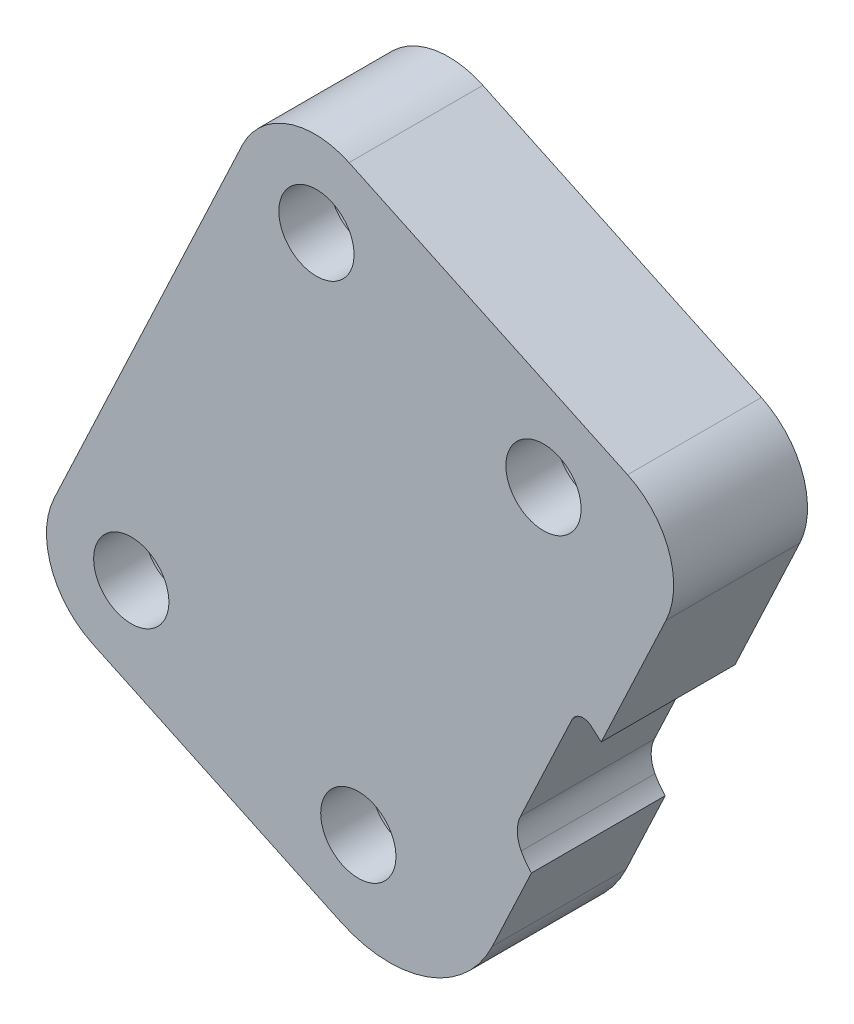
ISO-10303-21;
HEADER;
FILE_DESCRIPTION(('STEP AP214'),'2;1');
FILE_NAME('part.step','',(''),(''),'','','');
FILE_SCHEMA(('AUTOMOTIVE_DESIGN { 1 0 10303 214 1 1 1 1 }'));
ENDSEC;
DATA;
#1=APPLICATION_CONTEXT('core data for automotive mechanical design processes');
#2=APPLICATION_PROTOCOL_DEFINITION('international standard','automotive_design',2000,#1);
#3=PRODUCT_CONTEXT('',#1,'mechanical');
#4=PRODUCT('Part','Part','',(#3));
#5=PRODUCT_RELATED_PRODUCT_CATEGORY('part','',(#4));
#6=PRODUCT_DEFINITION_FORMATION('','',#4);
#7=PRODUCT_DEFINITION_CONTEXT('part definition',#1,'design');
#8=PRODUCT_DEFINITION('design','',#6,#7);
#9=PRODUCT_DEFINITION_SHAPE('','',#8);
#10=(LENGTH_UNIT() NAMED_UNIT(*) SI_UNIT(.MILLI.,.METRE.));
#11=(NAMED_UNIT(*) PLANE_ANGLE_UNIT() SI_UNIT($,.RADIAN.));
#12=(NAMED_UNIT(*) SI_UNIT($,.STERADIAN.) SOLID_ANGLE_UNIT());
#13=UNCERTAINTY_MEASURE_WITH_UNIT(LENGTH_MEASURE(1.E-05),#10,'distance_accuracy_value','');
#14=(GEOMETRIC_REPRESENTATION_CONTEXT(3) GLOBAL_UNCERTAINTY_ASSIGNED_CONTEXT((#13)) GLOBAL_UNIT_ASSIGNED_CONTEXT((#10,
#11,#12)) REPRESENTATION_CONTEXT('',''));
#15=CARTESIAN_POINT('',(0.,0.,0.));
#16=DIRECTION('',(0.,0.,1.));
#17=DIRECTION('',(1.,0.,0.));
#18=AXIS2_PLACEMENT_3D('',#15,#16,#17);
#19=CARTESIAN_POINT('',(-347.024105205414,7.1484132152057,15.8999999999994));
#20=DIRECTION('',(0.904832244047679,-0.425768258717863,0.));
#21=DIRECTION('',(0.425768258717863,0.904832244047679,0.));
#22=AXIS2_PLACEMENT_3D('',#19,#20,#21);
#23=PLANE('',#22);
#24=DIRECTION('',(0.,0.,1.));
#25=VECTOR('',#24,1.);
#26=CARTESIAN_POINT('',(-353.173963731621,-5.92111504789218,15.8999999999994));
#27=LINE('',#26,#25);
#28=CARTESIAN_POINT('',(-353.173963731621,-5.9211150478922,3.19999999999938));
#29=VERTEX_POINT('',#28);
#30=CARTESIAN_POINT('',(-353.173963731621,-5.9211150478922,15.8999999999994));
#31=VERTEX_POINT('',#30);
#32=EDGE_CURVE('E191',#29,#31,#27,.T.);
#33=ORIENTED_EDGE('',*,*,#32,.F.);
#34=DIRECTION('',(-0.425768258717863,-0.904832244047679,0.));
#35=VECTOR('',#34,1.);
#36=CARTESIAN_POINT('',(-347.024105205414,7.1484132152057,3.19999999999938));
#37=LINE('',#36,#35);
#38=CARTESIAN_POINT('',(-347.024105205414,7.1484132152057,3.19999999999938));
#39=VERTEX_POINT('',#38);
#40=EDGE_CURVE('E160',#39,#29,#37,.T.);
#41=ORIENTED_EDGE('',*,*,#40,.F.);
#42=DIRECTION('',(0.,0.,-1.));
#43=VECTOR('',#42,1.);
#44=CARTESIAN_POINT('',(-347.024105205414,7.1484132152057,15.8999999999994));
#45=LINE('',#44,#43);
#46=CARTESIAN_POINT('',(-347.024105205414,7.1484132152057,15.8999999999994));
#47=VERTEX_POINT('',#46);
#48=EDGE_CURVE('E105',#47,#39,#45,.T.);
#49=ORIENTED_EDGE('',*,*,#48,.F.);
#50=DIRECTION('',(-0.425768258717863,-0.904832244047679,0.));
#51=VECTOR('',#50,1.);
#52=CARTESIAN_POINT('',(-347.024105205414,7.1484132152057,15.8999999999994));
#53=LINE('',#52,#51);
#54=EDGE_CURVE('E236',#47,#31,#53,.T.);
#55=ORIENTED_EDGE('',*,*,#54,.T.);
#56=EDGE_LOOP('',(#33,#41,#49,#55));
#57=FACE_BOUND('',#56,.T.);
#58=ADVANCED_FACE('F43',(#57),#23,.T.);
#59=CARTESIAN_POINT('',(-353.918926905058,10.3927673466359,15.8999999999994));
#60=DIRECTION('',(0.,0.,-1.));
#61=DIRECTION('',(-1.,0.,0.));
#62=AXIS2_PLACEMENT_3D('',#59,#60,#61);
#63=CYLINDRICAL_SURFACE('',#62,7.62);
#64=CARTESIAN_POINT('',(-353.918926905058,10.3927673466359,3.19999999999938));
#65=DIRECTION('',(0.,0.,-1.));
#66=DIRECTION('',(1.,0.,0.));
#67=AXIS2_PLACEMENT_3D('',#64,#65,#66);
#68=CIRCLE('',#67,7.62);
#69=CARTESIAN_POINT('',(-350.674572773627,17.2875890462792,3.19999999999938));
#70=VERTEX_POINT('',#69);
#71=EDGE_CURVE('E155',#70,#39,#68,.T.);
#72=ORIENTED_EDGE('',*,*,#71,.F.);
#73=DIRECTION('',(0.,0.,-1.));
#74=VECTOR('',#73,1.);
#75=CARTESIAN_POINT('',(-350.674572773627,17.2875890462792,15.8999999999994));
#76=LINE('',#75,#74);
#77=CARTESIAN_POINT('',(-350.674572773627,17.2875890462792,15.8999999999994));
#78=VERTEX_POINT('',#77);
#79=EDGE_CURVE('E51',#78,#70,#76,.T.);
#80=ORIENTED_EDGE('',*,*,#79,.F.);
#81=CARTESIAN_POINT('',(-353.918926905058,10.3927673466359,15.8999999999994));
#82=DIRECTION('',(0.,0.,-1.));
#83=DIRECTION('',(1.,0.,0.));
#84=AXIS2_PLACEMENT_3D('',#81,#82,#83);
#85=CIRCLE('',#84,7.62);
#86=EDGE_CURVE('E178',#78,#47,#85,.T.);
#87=ORIENTED_EDGE('',*,*,#86,.T.);
#88=ORIENTED_EDGE('',*,*,#48,.T.);
#89=EDGE_LOOP('',(#72,#80,#87,#88));
#90=FACE_BOUND('',#89,.T.);
#91=ADVANCED_FACE('F45',(#90),#63,.T.);
#92=CARTESIAN_POINT('',(-350.674572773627,17.2875890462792,15.8999999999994));
#93=DIRECTION('',(0.425768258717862,0.904832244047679,0.));
#94=DIRECTION('',(-0.904832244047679,0.425768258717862,0.));
#95=AXIS2_PLACEMENT_3D('',#92,#93,#94);
#96=PLANE('',#95);
#97=DIRECTION('',(0.904832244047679,-0.425768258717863,0.));
#98=VECTOR('',#97,1.);
#99=CARTESIAN_POINT('',(-350.674572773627,17.2875890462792,3.19999999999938));
#100=LINE('',#99,#98);
#101=CARTESIAN_POINT('',(-377.10472262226,29.724279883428,3.19999999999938));
#102=VERTEX_POINT('',#101);
#103=EDGE_CURVE('E175',#102,#70,#100,.T.);
#104=ORIENTED_EDGE('',*,*,#103,.F.);
#105=DIRECTION('',(0.,0.,-1.));
#106=VECTOR('',#105,1.);
#107=CARTESIAN_POINT('',(-377.10472262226,29.724279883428,15.8999999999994));
#108=LINE('',#107,#106);
#109=CARTESIAN_POINT('',(-377.10472262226,29.724279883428,15.8999999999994));
#110=VERTEX_POINT('',#109);
#111=EDGE_CURVE('E135',#110,#102,#108,.T.);
#112=ORIENTED_EDGE('',*,*,#111,.F.);
#113=DIRECTION('',(0.904832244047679,-0.425768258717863,0.));
#114=VECTOR('',#113,1.);
#115=CARTESIAN_POINT('',(-350.674572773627,17.2875890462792,15.8999999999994));
#116=LINE('',#115,#114);
#117=EDGE_CURVE('E145',#110,#78,#116,.T.);
#118=ORIENTED_EDGE('',*,*,#117,.T.);
#119=ORIENTED_EDGE('',*,*,#79,.T.);
#120=EDGE_LOOP('',(#104,#112,#118,#119));
#121=FACE_BOUND('',#120,.T.);
#122=ADVANCED_FACE('F194',(#121),#96,.T.);
#123=CARTESIAN_POINT('',(-380.34907675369,22.8294581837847,15.8999999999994));
#124=DIRECTION('',(0.,0.,-1.));
#125=DIRECTION('',(-1.,0.,0.));
#126=AXIS2_PLACEMENT_3D('',#123,#124,#125);
#127=CYLINDRICAL_SURFACE('',#126,7.62);
#128=CARTESIAN_POINT('',(-380.34907675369,22.8294581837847,3.19999999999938));
#129=DIRECTION('',(0.,0.,-1.));
#130=DIRECTION('',(1.,0.,0.));
#131=AXIS2_PLACEMENT_3D('',#128,#129,#130);
#132=CIRCLE('',#131,7.62);
#133=CARTESIAN_POINT('',(-387.243898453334,26.0738123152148,3.19999999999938));
#134=VERTEX_POINT('',#133);
#135=EDGE_CURVE('E130',#134,#102,#132,.T.);
#136=ORIENTED_EDGE('',*,*,#135,.F.);
#137=DIRECTION('',(0.,0.,-1.));
#138=VECTOR('',#137,1.);
#139=CARTESIAN_POINT('',(-387.243898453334,26.0738123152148,15.8999999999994));
#140=LINE('',#139,#138);
#141=CARTESIAN_POINT('',(-387.243898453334,26.0738123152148,15.8999999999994));
#142=VERTEX_POINT('',#141);
#143=EDGE_CURVE('E124',#142,#134,#140,.T.);
#144=ORIENTED_EDGE('',*,*,#143,.F.);
#145=CARTESIAN_POINT('',(-380.34907675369,22.8294581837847,15.8999999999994));
#146=DIRECTION('',(0.,0.,-1.));
#147=DIRECTION('',(1.,0.,0.));
#148=AXIS2_PLACEMENT_3D('',#145,#146,#147);
#149=CIRCLE('',#148,7.62);
#150=EDGE_CURVE('E127',#142,#110,#149,.T.);
#151=ORIENTED_EDGE('',*,*,#150,.T.);
#152=ORIENTED_EDGE('',*,*,#111,.T.);
#153=EDGE_LOOP('',(#136,#144,#151,#152));
#154=FACE_BOUND('',#153,.T.);
#155=ADVANCED_FACE('F126',(#154),#127,.T.);
#156=CARTESIAN_POINT('',(-387.243898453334,26.0738123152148,15.8999999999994));
#157=DIRECTION('',(-0.904832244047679,0.425768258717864,0.));
#158=DIRECTION('',(-0.425768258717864,-0.904832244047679,0.));
#159=AXIS2_PLACEMENT_3D('',#156,#157,#158);
#160=PLANE('',#159);
#161=DIRECTION('',(0.425768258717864,0.904832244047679,0.));
#162=VECTOR('',#161,1.);
#163=CARTESIAN_POINT('',(-387.243898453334,26.0738123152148,3.19999999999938));
#164=LINE('',#163,#162);
#165=CARTESIAN_POINT('',(-405.087846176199,-11.8477070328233,3.19999999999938));
#166=VERTEX_POINT('',#165);
#167=EDGE_CURVE('E172',#166,#134,#164,.T.);
#168=ORIENTED_EDGE('',*,*,#167,.F.);
#169=DIRECTION('',(0.,0.,-1.));
#170=VECTOR('',#169,1.);
#171=CARTESIAN_POINT('',(-405.087846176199,-11.8477070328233,15.8999999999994));
#172=LINE('',#171,#170);
#173=CARTESIAN_POINT('',(-405.087846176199,-11.8477070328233,15.8999999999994));
#174=VERTEX_POINT('',#173);
#175=EDGE_CURVE('E136',#174,#166,#172,.T.);
#176=ORIENTED_EDGE('',*,*,#175,.F.);
#177=DIRECTION('',(0.425768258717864,0.904832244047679,0.));
#178=VECTOR('',#177,1.);
#179=CARTESIAN_POINT('',(-387.243898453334,26.0738123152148,15.8999999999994));
#180=LINE('',#179,#178);
#181=EDGE_CURVE('E143',#174,#142,#180,.T.);
#182=ORIENTED_EDGE('',*,*,#181,.T.);
#183=ORIENTED_EDGE('',*,*,#143,.T.);
#184=EDGE_LOOP('',(#168,#176,#182,#183));
#185=FACE_BOUND('',#184,.T.);
#186=ADVANCED_FACE('F147',(#185),#160,.T.);
#187=CARTESIAN_POINT('',(-398.193024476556,-15.0920611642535,15.8999999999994));
#188=DIRECTION('',(0.,0.,-1.));
#189=DIRECTION('',(-1.,0.,0.));
#190=AXIS2_PLACEMENT_3D('',#187,#188,#189);
#191=CYLINDRICAL_SURFACE('',#190,7.62000000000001);
#192=CARTESIAN_POINT('',(-398.193024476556,-15.0920611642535,3.19999999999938));
#193=DIRECTION('',(0.,0.,-1.));
#194=DIRECTION('',(-1.,0.,0.));
#195=AXIS2_PLACEMENT_3D('',#192,#193,#194);
#196=CIRCLE('',#195,7.62000000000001);
#197=CARTESIAN_POINT('',(-401.437378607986,-21.9868828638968,3.19999999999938));
#198=VERTEX_POINT('',#197);
#199=EDGE_CURVE('E169',#198,#166,#196,.T.);
#200=ORIENTED_EDGE('',*,*,#199,.F.);
#201=DIRECTION('',(0.,0.,-1.));
#202=VECTOR('',#201,1.);
#203=CARTESIAN_POINT('',(-401.437378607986,-21.9868828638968,15.8999999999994));
#204=LINE('',#203,#202);
#205=CARTESIAN_POINT('',(-401.437378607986,-21.9868828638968,15.8999999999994));
#206=VERTEX_POINT('',#205);
#207=EDGE_CURVE('E182',#206,#198,#204,.T.);
#208=ORIENTED_EDGE('',*,*,#207,.F.);
#209=CARTESIAN_POINT('',(-398.193024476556,-15.0920611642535,15.8999999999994));
#210=DIRECTION('',(0.,0.,-1.));
#211=DIRECTION('',(-1.,0.,0.));
#212=AXIS2_PLACEMENT_3D('',#209,#210,#211);
#213=CIRCLE('',#212,7.62000000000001);
#214=EDGE_CURVE('E148',#206,#174,#213,.T.);
#215=ORIENTED_EDGE('',*,*,#214,.T.);
#216=ORIENTED_EDGE('',*,*,#175,.T.);
#217=EDGE_LOOP('',(#200,#208,#215,#216));
#218=FACE_BOUND('',#217,.T.);
#219=ADVANCED_FACE('F590',(#218),#191,.T.);
#220=CARTESIAN_POINT('',(-377.880071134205,-33.0717594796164,15.8999999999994));
#221=DIRECTION('',(-0.425768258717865,-0.904832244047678,0.));
#222=DIRECTION('',(0.904832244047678,-0.425768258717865,0.));
#223=AXIS2_PLACEMENT_3D('',#220,#221,#222);
#224=PLANE('',#223);
#225=DIRECTION('',(-0.904832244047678,0.425768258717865,0.));
#226=VECTOR('',#225,1.);
#227=CARTESIAN_POINT('',(-377.880071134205,-33.0717594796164,3.19999999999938));
#228=LINE('',#227,#226);
#229=CARTESIAN_POINT('',(-377.880071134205,-33.0717594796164,3.19999999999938));
#230=VERTEX_POINT('',#229);
#231=EDGE_CURVE('E166',#230,#198,#228,.T.);
#232=ORIENTED_EDGE('',*,*,#231,.F.);
#233=DIRECTION('',(0.,0.,-1.));
#234=VECTOR('',#233,1.);
#235=CARTESIAN_POINT('',(-377.880071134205,-33.0717594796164,15.8999999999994));
#236=LINE('',#235,#234);
#237=CARTESIAN_POINT('',(-377.880071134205,-33.0717594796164,15.8999999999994));
#238=VERTEX_POINT('',#237);
#239=EDGE_CURVE('E184',#238,#230,#236,.T.);
#240=ORIENTED_EDGE('',*,*,#239,.F.);
#241=DIRECTION('',(-0.904832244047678,0.425768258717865,0.));
#242=VECTOR('',#241,1.);
#243=CARTESIAN_POINT('',(-377.880071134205,-33.0717594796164,15.8999999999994));
#244=LINE('',#243,#242);
#245=EDGE_CURVE('E150',#238,#206,#244,.T.);
#246=ORIENTED_EDGE('',*,*,#245,.T.);
#247=ORIENTED_EDGE('',*,*,#207,.T.);
#248=EDGE_LOOP('',(#232,#240,#246,#247));
#249=FACE_BOUND('',#248,.T.);
#250=ADVANCED_FACE('F218',(#249),#224,.T.);
#251=CARTESIAN_POINT('',(-373.283902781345,-23.3040954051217,15.8999999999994));
#252=DIRECTION('',(0.,0.,-1.));
#253=DIRECTION('',(-1.,0.,0.));
#254=AXIS2_PLACEMENT_3D('',#251,#252,#253);
#255=CYLINDRICAL_SURFACE('',#254,10.795);
#256=CARTESIAN_POINT('',(-373.283902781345,-23.3040954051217,3.19999999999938));
#257=DIRECTION('',(0.,0.,-1.));
#258=DIRECTION('',(-1.,0.,0.));
#259=AXIS2_PLACEMENT_3D('',#256,#257,#258);
#260=CIRCLE('',#259,10.795);
#261=CARTESIAN_POINT('',(-363.516238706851,-27.9002637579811,3.19999999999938));
#262=VERTEX_POINT('',#261);
#263=EDGE_CURVE('E163',#262,#230,#260,.T.);
#264=ORIENTED_EDGE('',*,*,#263,.F.);
#265=DIRECTION('',(0.,0.,-1.));
#266=VECTOR('',#265,1.);
#267=CARTESIAN_POINT('',(-363.516238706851,-27.9002637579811,15.8999999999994));
#268=LINE('',#267,#266);
#269=CARTESIAN_POINT('',(-363.516238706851,-27.9002637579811,15.8999999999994));
#270=VERTEX_POINT('',#269);
#271=EDGE_CURVE('E186',#270,#262,#268,.T.);
#272=ORIENTED_EDGE('',*,*,#271,.F.);
#273=CARTESIAN_POINT('',(-373.283902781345,-23.3040954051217,15.8999999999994));
#274=DIRECTION('',(0.,0.,-1.));
#275=DIRECTION('',(-1.,0.,0.));
#276=AXIS2_PLACEMENT_3D('',#273,#274,#275);
#277=CIRCLE('',#276,10.795);
#278=EDGE_CURVE('E235',#270,#238,#277,.T.);
#279=ORIENTED_EDGE('',*,*,#278,.T.);
#280=ORIENTED_EDGE('',*,*,#239,.T.);
#281=EDGE_LOOP('',(#264,#272,#279,#280));
#282=FACE_BOUND('',#281,.T.);
#283=ADVANCED_FACE('F210',(#282),#255,.T.);
#284=DIRECTION('',(0.,0.,1.));
#285=VECTOR('',#284,1.);
#286=CARTESIAN_POINT('',(-359.799879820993,-20.0023491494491,3.19999999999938));
#287=LINE('',#286,#285);
#288=CARTESIAN_POINT('',(-359.799879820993,-20.0023491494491,15.8999999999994));
#289=VERTEX_POINT('',#288);
#290=CARTESIAN_POINT('',(-359.799879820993,-20.0023491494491,3.19999999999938));
#291=VERTEX_POINT('',#290);
#292=EDGE_CURVE('E58',#289,#291,#287,.F.);
#293=ORIENTED_EDGE('',*,*,#292,.F.);
#294=EDGE_CURVE('E223',#289,#270,#53,.T.);
#295=ORIENTED_EDGE('',*,*,#294,.T.);
#296=ORIENTED_EDGE('',*,*,#271,.T.);
#297=EDGE_CURVE('E158',#291,#262,#37,.T.);
#298=ORIENTED_EDGE('',*,*,#297,.F.);
#299=EDGE_LOOP('',(#293,#295,#296,#298));
#300=FACE_BOUND('',#299,.T.);
#301=ADVANCED_FACE('F204',(#300),#23,.T.);
#302=CARTESIAN_POINT('',(-353.918926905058,10.3927673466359,15.8999999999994));
#303=DIRECTION('',(0.,0.,1.));
#304=DIRECTION('',(1.,0.,0.));
#305=AXIS2_PLACEMENT_3D('',#302,#303,#304);
#306=PLANE('',#305);
#307=CARTESIAN_POINT('',(-380.196973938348,22.4069925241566,15.8999999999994));
#308=DIRECTION('',(0.,0.,-1.));
#309=DIRECTION('',(-1.,0.,0.));
#310=AXIS2_PLACEMENT_3D('',#307,#308,#309);
#311=CIRCLE('',#310,3.56869999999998);
#312=CARTESIAN_POINT('',(-383.765673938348,22.4069925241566,15.8999999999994));
#313=VERTEX_POINT('',#312);
#314=EDGE_CURVE('E366',#313,#313,#311,.T.);
#315=ORIENTED_EDGE('',*,*,#314,.T.);
#316=EDGE_LOOP('',(#315));
#317=FACE_BOUND('',#316,.T.);
#318=CARTESIAN_POINT('',(-376.224241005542,-25.0785650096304,15.8999999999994));
#319=DIRECTION('',(0.,0.,-1.));
#320=DIRECTION('',(-1.,0.,0.));
#321=AXIS2_PLACEMENT_3D('',#318,#319,#320);
#322=CIRCLE('',#321,3.56869999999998);
#323=CARTESIAN_POINT('',(-379.792941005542,-25.0785650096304,15.8999999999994));
#324=VERTEX_POINT('',#323);
#325=EDGE_CURVE('E356',#324,#324,#322,.T.);
#326=ORIENTED_EDGE('',*,*,#325,.T.);
#327=EDGE_LOOP('',(#326));
#328=FACE_BOUND('',#327,.T.);
#329=CARTESIAN_POINT('',(-397.770558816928,-14.9399583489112,15.8999999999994));
#330=DIRECTION('',(0.,0.,-1.));
#331=DIRECTION('',(-1.,0.,0.));
#332=AXIS2_PLACEMENT_3D('',#329,#330,#331);
#333=CIRCLE('',#332,3.56869999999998);
#334=CARTESIAN_POINT('',(-401.339258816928,-14.9399583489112,15.8999999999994));
#335=VERTEX_POINT('',#334);
#336=EDGE_CURVE('E346',#335,#335,#333,.T.);
#337=ORIENTED_EDGE('',*,*,#336,.T.);
#338=EDGE_LOOP('',(#337));
#339=FACE_BOUND('',#338,.T.);
#340=CARTESIAN_POINT('',(-358.650656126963,12.2683858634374,15.8999999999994));
#341=DIRECTION('',(0.,0.,-1.));
#342=DIRECTION('',(-1.,0.,0.));
#343=AXIS2_PLACEMENT_3D('',#340,#341,#342);
#344=CIRCLE('',#343,3.56869999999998);
#345=CARTESIAN_POINT('',(-362.219356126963,12.2683858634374,15.8999999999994));
#346=VERTEX_POINT('',#345);
#347=EDGE_CURVE('E336',#346,#346,#344,.T.);
#348=ORIENTED_EDGE('',*,*,#347,.T.);
#349=EDGE_LOOP('',(#348));
#350=FACE_BOUND('',#349,.T.);
#351=DIRECTION('',(-0.755030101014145,0.655690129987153,0.));
#352=VECTOR('',#351,1.);
#353=CARTESIAN_POINT('',(-361.675090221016,1.46151079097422,15.8999999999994));
#354=LINE('',#353,#352);
#355=CARTESIAN_POINT('',(-354.134813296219,-5.08668530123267,15.8999999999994));
#356=VERTEX_POINT('',#355);
#357=EDGE_CURVE('E227',#31,#356,#354,.T.);
#358=ORIENTED_EDGE('',*,*,#357,.F.);
#359=ORIENTED_EDGE('',*,*,#54,.F.);
#360=ORIENTED_EDGE('',*,*,#86,.F.);
#361=ORIENTED_EDGE('',*,*,#117,.F.);
#362=ORIENTED_EDGE('',*,*,#150,.F.);
#363=ORIENTED_EDGE('',*,*,#181,.F.);
#364=ORIENTED_EDGE('',*,*,#214,.F.);
#365=ORIENTED_EDGE('',*,*,#245,.F.);
#366=ORIENTED_EDGE('',*,*,#278,.F.);
#367=ORIENTED_EDGE('',*,*,#294,.F.);
#368=CARTESIAN_POINT('',(-355.705949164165,-15.9990361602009,15.8999999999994));
#369=DIRECTION('',(0.,0.,1.));
#370=DIRECTION('',(1.,0.,0.));
#371=AXIS2_PLACEMENT_3D('',#368,#369,#370);
#372=CIRCLE('',#371,5.72597442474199);
#373=CARTESIAN_POINT('',(-360.76720793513,-18.6768044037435,15.8999999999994));
#374=VERTEX_POINT('',#373);
#375=EDGE_CURVE('E228',#374,#289,#372,.T.);
#376=ORIENTED_EDGE('',*,*,#375,.F.);
#377=CARTESIAN_POINT('',(-357.977308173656,-17.2007476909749,15.8999999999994));
#378=DIRECTION('',(0.,0.,1.));
#379=DIRECTION('',(1.,0.,0.));
#380=AXIS2_PLACEMENT_3D('',#377,#378,#379);
#381=CIRCLE('',#380,3.15630861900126);
#382=CARTESIAN_POINT('',(-360.833237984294,-15.8568916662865,15.8999999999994));
#383=VERTEX_POINT('',#382);
#384=EDGE_CURVE('E159',#383,#374,#381,.T.);
#385=ORIENTED_EDGE('',*,*,#384,.F.);
#386=DIRECTION('',(-0.425768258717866,-0.904832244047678,0.));
#387=VECTOR('',#386,1.);
#388=CARTESIAN_POINT('',(-349.467170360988,8.29799602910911,15.8999999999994));
#389=LINE('',#388,#387);
#390=CARTESIAN_POINT('',(-355.945050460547,-5.46863562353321,15.8999999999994));
#391=VERTEX_POINT('',#390);
#392=EDGE_CURVE('E281',#391,#383,#389,.T.);
#393=ORIENTED_EDGE('',*,*,#392,.F.);
#394=CARTESIAN_POINT('',(-354.895426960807,-5.9625353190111,15.8999999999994));
#395=DIRECTION('',(0.,0.,1.));
#396=DIRECTION('',(1.,0.,0.));
#397=AXIS2_PLACEMENT_3D('',#394,#395,#396);
#398=CIRCLE('',#397,1.16002);
#399=EDGE_CURVE('E278',#356,#391,#398,.T.);
#400=ORIENTED_EDGE('',*,*,#399,.F.);
#401=EDGE_LOOP('',(#358,#359,#360,#361,#362,#363,#364,#365,#366,#367,#376,#385,#393,#400));
#402=FACE_BOUND('',#401,.T.);
#403=ADVANCED_FACE('F141',(#317,#328,#339,#350,#402),#306,.T.);
#404=CARTESIAN_POINT('',(-353.918926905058,10.3927673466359,3.19999999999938));
#405=DIRECTION('',(0.,0.,1.));
#406=DIRECTION('',(1.,0.,0.));
#407=AXIS2_PLACEMENT_3D('',#404,#405,#406);
#408=PLANE('',#407);
#409=CARTESIAN_POINT('',(-380.196973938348,22.4069925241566,3.19999999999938));
#410=DIRECTION('',(0.,0.,-1.));
#411=DIRECTION('',(-1.,0.,0.));
#412=AXIS2_PLACEMENT_3D('',#409,#410,#411);
#413=CIRCLE('',#412,5.35940000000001);
#414=CARTESIAN_POINT('',(-385.556373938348,22.4069925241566,3.19999999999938));
#415=VERTEX_POINT('',#414);
#416=EDGE_CURVE('E317',#415,#415,#413,.T.);
#417=ORIENTED_EDGE('',*,*,#416,.F.);
#418=EDGE_LOOP('',(#417));
#419=FACE_BOUND('',#418,.T.);
#420=CARTESIAN_POINT('',(-376.224241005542,-25.0785650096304,3.19999999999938));
#421=DIRECTION('',(0.,0.,-1.));
#422=DIRECTION('',(-1.,0.,0.));
#423=AXIS2_PLACEMENT_3D('',#420,#421,#422);
#424=CIRCLE('',#423,5.35940000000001);
#425=CARTESIAN_POINT('',(-381.583641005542,-25.0785650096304,3.19999999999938));
#426=VERTEX_POINT('',#425);
#427=EDGE_CURVE('E321',#426,#426,#424,.T.);
#428=ORIENTED_EDGE('',*,*,#427,.F.);
#429=EDGE_LOOP('',(#428));
#430=FACE_BOUND('',#429,.T.);
#431=CARTESIAN_POINT('',(-397.770558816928,-14.9399583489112,3.19999999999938));
#432=DIRECTION('',(0.,0.,-1.));
#433=DIRECTION('',(-1.,0.,0.));
#434=AXIS2_PLACEMENT_3D('',#431,#432,#433);
#435=CIRCLE('',#434,5.35940000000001);
#436=CARTESIAN_POINT('',(-403.129958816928,-14.9399583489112,3.19999999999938));
#437=VERTEX_POINT('',#436);
#438=EDGE_CURVE('E325',#437,#437,#435,.T.);
#439=ORIENTED_EDGE('',*,*,#438,.F.);
#440=EDGE_LOOP('',(#439));
#441=FACE_BOUND('',#440,.T.);
#442=CARTESIAN_POINT('',(-358.650656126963,12.2683858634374,3.19999999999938));
#443=DIRECTION('',(0.,0.,-1.));
#444=DIRECTION('',(-1.,0.,0.));
#445=AXIS2_PLACEMENT_3D('',#442,#443,#444);
#446=CIRCLE('',#445,5.35940000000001);
#447=CARTESIAN_POINT('',(-364.010056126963,12.2683858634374,3.19999999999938));
#448=VERTEX_POINT('',#447);
#449=EDGE_CURVE('E258',#448,#448,#446,.T.);
#450=ORIENTED_EDGE('',*,*,#449,.F.);
#451=EDGE_LOOP('',(#450));
#452=FACE_BOUND('',#451,.T.);
#453=ORIENTED_EDGE('',*,*,#40,.T.);
#454=DIRECTION('',(-0.755030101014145,0.655690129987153,0.));
#455=VECTOR('',#454,1.);
#456=CARTESIAN_POINT('',(-361.675090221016,1.46151079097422,3.19999999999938));
#457=LINE('',#456,#455);
#458=CARTESIAN_POINT('',(-354.134813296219,-5.08668530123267,3.19999999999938));
#459=VERTEX_POINT('',#458);
#460=EDGE_CURVE('E11',#29,#459,#457,.T.);
#461=ORIENTED_EDGE('',*,*,#460,.T.);
#462=CARTESIAN_POINT('',(-354.895426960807,-5.9625353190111,3.19999999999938));
#463=DIRECTION('',(0.,0.,1.));
#464=DIRECTION('',(1.,0.,0.));
#465=AXIS2_PLACEMENT_3D('',#462,#463,#464);
#466=CIRCLE('',#465,1.16002);
#467=CARTESIAN_POINT('',(-355.945050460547,-5.46863562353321,3.19999999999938));
#468=VERTEX_POINT('',#467);
#469=EDGE_CURVE('E253',#459,#468,#466,.T.);
#470=ORIENTED_EDGE('',*,*,#469,.T.);
#471=DIRECTION('',(-0.425768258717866,-0.904832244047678,0.));
#472=VECTOR('',#471,1.);
#473=CARTESIAN_POINT('',(-360.833237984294,-15.8568916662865,3.19999999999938));
#474=LINE('',#473,#472);
#475=CARTESIAN_POINT('',(-360.833237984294,-15.8568916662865,3.19999999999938));
#476=VERTEX_POINT('',#475);
#477=EDGE_CURVE('E256',#468,#476,#474,.T.);
#478=ORIENTED_EDGE('',*,*,#477,.T.);
#479=CARTESIAN_POINT('',(-357.977308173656,-17.2007476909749,3.19999999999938));
#480=DIRECTION('',(0.,0.,1.));
#481=DIRECTION('',(1.,0.,0.));
#482=AXIS2_PLACEMENT_3D('',#479,#480,#481);
#483=CIRCLE('',#482,3.15630861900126);
#484=CARTESIAN_POINT('',(-360.76720793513,-18.6768044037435,3.19999999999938));
#485=VERTEX_POINT('',#484);
#486=EDGE_CURVE('E251',#476,#485,#483,.T.);
#487=ORIENTED_EDGE('',*,*,#486,.T.);
#488=CARTESIAN_POINT('',(-355.705949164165,-15.9990361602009,3.19999999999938));
#489=DIRECTION('',(0.,0.,1.));
#490=DIRECTION('',(1.,0.,0.));
#491=AXIS2_PLACEMENT_3D('',#488,#489,#490);
#492=CIRCLE('',#491,5.72597442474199);
#493=EDGE_CURVE('E247',#485,#291,#492,.T.);
#494=ORIENTED_EDGE('',*,*,#493,.T.);
#495=ORIENTED_EDGE('',*,*,#297,.T.);
#496=ORIENTED_EDGE('',*,*,#263,.T.);
#497=ORIENTED_EDGE('',*,*,#231,.T.);
#498=ORIENTED_EDGE('',*,*,#199,.T.);
#499=ORIENTED_EDGE('',*,*,#167,.T.);
#500=ORIENTED_EDGE('',*,*,#135,.T.);
#501=ORIENTED_EDGE('',*,*,#103,.T.);
#502=ORIENTED_EDGE('',*,*,#71,.T.);
#503=EDGE_LOOP('',(#453,#461,#470,#478,#487,#494,#495,#496,#497,#498,#499,#500,#501,#502));
#504=FACE_BOUND('',#503,.T.);
#505=ADVANCED_FACE('F193',(#419,#430,#441,#452,#504),#408,.F.);
#506=CARTESIAN_POINT('',(-357.977308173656,-17.2007476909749,3.19999999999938));
#507=DIRECTION('',(0.,0.,1.));
#508=DIRECTION('',(1.,0.,0.));
#509=AXIS2_PLACEMENT_3D('',#506,#507,#508);
#510=CYLINDRICAL_SURFACE('',#509,3.15630861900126);
#511=ORIENTED_EDGE('',*,*,#384,.T.);
#512=DIRECTION('',(0.,0.,1.));
#513=VECTOR('',#512,1.);
#514=CARTESIAN_POINT('',(-360.76720793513,-18.6768044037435,3.19999999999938));
#515=LINE('',#514,#513);
#516=EDGE_CURVE('E263',#485,#374,#515,.T.);
#517=ORIENTED_EDGE('',*,*,#516,.F.);
#518=ORIENTED_EDGE('',*,*,#486,.F.);
#519=DIRECTION('',(0.,0.,1.));
#520=VECTOR('',#519,1.);
#521=CARTESIAN_POINT('',(-360.833237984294,-15.8568916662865,3.19999999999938));
#522=LINE('',#521,#520);
#523=EDGE_CURVE('E264',#476,#383,#522,.T.);
#524=ORIENTED_EDGE('',*,*,#523,.T.);
#525=EDGE_LOOP('',(#511,#517,#518,#524));
#526=FACE_BOUND('',#525,.T.);
#527=ADVANCED_FACE('F286',(#526),#510,.F.);
#528=CARTESIAN_POINT('',(-360.833237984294,-15.8568916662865,3.19999999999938));
#529=DIRECTION('',(-0.904832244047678,0.425768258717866,0.));
#530=DIRECTION('',(-0.425768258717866,-0.904832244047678,0.));
#531=AXIS2_PLACEMENT_3D('',#528,#529,#530);
#532=PLANE('',#531);
#533=ORIENTED_EDGE('',*,*,#392,.T.);
#534=ORIENTED_EDGE('',*,*,#523,.F.);
#535=ORIENTED_EDGE('',*,*,#477,.F.);
#536=DIRECTION('',(0.,0.,1.));
#537=VECTOR('',#536,1.);
#538=CARTESIAN_POINT('',(-355.945050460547,-5.46863562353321,3.19999999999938));
#539=LINE('',#538,#537);
#540=EDGE_CURVE('E267',#468,#391,#539,.T.);
#541=ORIENTED_EDGE('',*,*,#540,.T.);
#542=EDGE_LOOP('',(#533,#534,#535,#541));
#543=FACE_BOUND('',#542,.T.);
#544=ADVANCED_FACE('F308',(#543),#532,.F.);
#545=CARTESIAN_POINT('',(-354.895426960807,-5.9625353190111,3.19999999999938));
#546=DIRECTION('',(0.,0.,1.));
#547=DIRECTION('',(1.,0.,0.));
#548=AXIS2_PLACEMENT_3D('',#545,#546,#547);
#549=CYLINDRICAL_SURFACE('',#548,1.16002);
#550=ORIENTED_EDGE('',*,*,#399,.T.);
#551=ORIENTED_EDGE('',*,*,#540,.F.);
#552=ORIENTED_EDGE('',*,*,#469,.F.);
#553=DIRECTION('',(0.,0.,1.));
#554=VECTOR('',#553,1.);
#555=CARTESIAN_POINT('',(-354.134813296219,-5.08668530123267,3.19999999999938));
#556=LINE('',#555,#554);
#557=EDGE_CURVE('E270',#459,#356,#556,.T.);
#558=ORIENTED_EDGE('',*,*,#557,.T.);
#559=EDGE_LOOP('',(#550,#551,#552,#558));
#560=FACE_BOUND('',#559,.T.);
#561=ADVANCED_FACE('F303',(#560),#549,.F.);
#562=CARTESIAN_POINT('',(-354.134813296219,-5.08668530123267,3.19999999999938));
#563=DIRECTION('',(0.655690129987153,0.755030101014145,0.));
#564=DIRECTION('',(-0.755030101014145,0.655690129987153,0.));
#565=AXIS2_PLACEMENT_3D('',#562,#563,#564);
#566=PLANE('',#565);
#567=ORIENTED_EDGE('',*,*,#32,.T.);
#568=ORIENTED_EDGE('',*,*,#357,.T.);
#569=ORIENTED_EDGE('',*,*,#557,.F.);
#570=ORIENTED_EDGE('',*,*,#460,.F.);
#571=EDGE_LOOP('',(#567,#568,#569,#570));
#572=FACE_BOUND('',#571,.T.);
#573=ADVANCED_FACE('F294',(#572),#566,.F.);
#574=CARTESIAN_POINT('',(-355.705949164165,-15.9990361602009,3.19999999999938));
#575=DIRECTION('',(0.,0.,1.));
#576=DIRECTION('',(1.,0.,0.));
#577=AXIS2_PLACEMENT_3D('',#574,#575,#576);
#578=CYLINDRICAL_SURFACE('',#577,5.72597442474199);
#579=ORIENTED_EDGE('',*,*,#292,.T.);
#580=ORIENTED_EDGE('',*,*,#493,.F.);
#581=ORIENTED_EDGE('',*,*,#516,.T.);
#582=ORIENTED_EDGE('',*,*,#375,.T.);
#583=EDGE_LOOP('',(#579,#580,#581,#582));
#584=FACE_BOUND('',#583,.T.);
#585=ADVANCED_FACE('F291',(#584),#578,.F.);
#586=CARTESIAN_POINT('',(-358.650656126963,12.2683858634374,3.19999999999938));
#587=DIRECTION('',(0.,0.,-1.));
#588=DIRECTION('',(-1.,0.,0.));
#589=AXIS2_PLACEMENT_3D('',#586,#587,#588);
#590=CYLINDRICAL_SURFACE('',#589,5.35940000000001);
#591=CARTESIAN_POINT('',(-358.650656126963,12.2683858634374,11.0739999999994));
#592=DIRECTION('',(0.,0.,-1.));
#593=DIRECTION('',(-1.,0.,0.));
#594=AXIS2_PLACEMENT_3D('',#591,#592,#593);
#595=CIRCLE('',#594,5.35940000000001);
#596=CARTESIAN_POINT('',(-364.010056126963,12.2683858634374,11.0739999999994));
#597=VERTEX_POINT('',#596);
#598=EDGE_CURVE('E329',#597,#597,#595,.T.);
#599=ORIENTED_EDGE('',*,*,#598,.F.);
#600=EDGE_LOOP('',(#599));
#601=FACE_BOUND('',#600,.T.);
#602=ORIENTED_EDGE('',*,*,#449,.T.);
#603=EDGE_LOOP('',(#602));
#604=FACE_BOUND('',#603,.T.);
#605=ADVANCED_FACE('F293',(#601,#604),#590,.F.);
#606=CARTESIAN_POINT('',(-355.081956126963,12.2683858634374,11.0739999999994));
#607=DIRECTION('',(0.,0.,1.));
#608=DIRECTION('',(1.,0.,0.));
#609=AXIS2_PLACEMENT_3D('',#606,#607,#608);
#610=PLANE('',#609);
#611=CARTESIAN_POINT('',(-358.650656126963,12.2683858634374,11.0739999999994));
#612=DIRECTION('',(0.,0.,-1.));
#613=DIRECTION('',(-1.,0.,0.));
#614=AXIS2_PLACEMENT_3D('',#611,#612,#613);
#615=CIRCLE('',#614,3.56869999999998);
#616=CARTESIAN_POINT('',(-362.219356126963,12.2683858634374,11.0739999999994));
#617=VERTEX_POINT('',#616);
#618=EDGE_CURVE('E331',#617,#617,#615,.T.);
#619=ORIENTED_EDGE('',*,*,#618,.F.);
#620=EDGE_LOOP('',(#619));
#621=FACE_BOUND('',#620,.T.);
#622=ORIENTED_EDGE('',*,*,#598,.T.);
#623=EDGE_LOOP('',(#622));
#624=FACE_BOUND('',#623,.T.);
#625=ADVANCED_FACE('F300',(#621,#624),#610,.F.);
#626=CARTESIAN_POINT('',(-358.650656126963,12.2683858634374,3.19999999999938));
#627=DIRECTION('',(0.,0.,-1.));
#628=DIRECTION('',(-1.,0.,0.));
#629=AXIS2_PLACEMENT_3D('',#626,#627,#628);
#630=CYLINDRICAL_SURFACE('',#629,3.56869999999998);
#631=ORIENTED_EDGE('',*,*,#347,.F.);
#632=EDGE_LOOP('',(#631));
#633=FACE_BOUND('',#632,.T.);
#634=ORIENTED_EDGE('',*,*,#618,.T.);
#635=EDGE_LOOP('',(#634));
#636=FACE_BOUND('',#635,.T.);
#637=ADVANCED_FACE('F413',(#633,#636),#630,.F.);
#638=CARTESIAN_POINT('',(-397.770558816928,-14.9399583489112,3.19999999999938));
#639=DIRECTION('',(0.,0.,-1.));
#640=DIRECTION('',(-1.,0.,0.));
#641=AXIS2_PLACEMENT_3D('',#638,#639,#640);
#642=CYLINDRICAL_SURFACE('',#641,5.35940000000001);
#643=CARTESIAN_POINT('',(-397.770558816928,-14.9399583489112,11.0739999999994));
#644=DIRECTION('',(0.,0.,-1.));
#645=DIRECTION('',(-1.,0.,0.));
#646=AXIS2_PLACEMENT_3D('',#643,#644,#645);
#647=CIRCLE('',#646,5.35940000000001);
#648=CARTESIAN_POINT('',(-403.129958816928,-14.9399583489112,11.0739999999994));
#649=VERTEX_POINT('',#648);
#650=EDGE_CURVE('E340',#649,#649,#647,.T.);
#651=ORIENTED_EDGE('',*,*,#650,.F.);
#652=EDGE_LOOP('',(#651));
#653=FACE_BOUND('',#652,.T.);
#654=ORIENTED_EDGE('',*,*,#438,.T.);
#655=EDGE_LOOP('',(#654));
#656=FACE_BOUND('',#655,.T.);
#657=ADVANCED_FACE('F409',(#653,#656),#642,.F.);
#658=CARTESIAN_POINT('',(-394.201858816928,-14.9399583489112,11.0739999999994));
#659=DIRECTION('',(0.,0.,1.));
#660=DIRECTION('',(1.,0.,0.));
#661=AXIS2_PLACEMENT_3D('',#658,#659,#660);
#662=PLANE('',#661);
#663=CARTESIAN_POINT('',(-397.770558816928,-14.9399583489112,11.0739999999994));
#664=DIRECTION('',(0.,0.,-1.));
#665=DIRECTION('',(-1.,0.,0.));
#666=AXIS2_PLACEMENT_3D('',#663,#664,#665);
#667=CIRCLE('',#666,3.56869999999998);
#668=CARTESIAN_POINT('',(-401.339258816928,-14.9399583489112,11.0739999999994));
#669=VERTEX_POINT('',#668);
#670=EDGE_CURVE('E343',#669,#669,#667,.T.);
#671=ORIENTED_EDGE('',*,*,#670,.F.);
#672=EDGE_LOOP('',(#671));
#673=FACE_BOUND('',#672,.T.);
#674=ORIENTED_EDGE('',*,*,#650,.T.);
#675=EDGE_LOOP('',(#674));
#676=FACE_BOUND('',#675,.T.);
#677=ADVANCED_FACE('F405',(#673,#676),#662,.F.);
#678=CARTESIAN_POINT('',(-397.770558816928,-14.9399583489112,3.19999999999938));
#679=DIRECTION('',(0.,0.,-1.));
#680=DIRECTION('',(-1.,0.,0.));
#681=AXIS2_PLACEMENT_3D('',#678,#679,#680);
#682=CYLINDRICAL_SURFACE('',#681,3.56869999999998);
#683=ORIENTED_EDGE('',*,*,#336,.F.);
#684=EDGE_LOOP('',(#683));
#685=FACE_BOUND('',#684,.T.);
#686=ORIENTED_EDGE('',*,*,#670,.T.);
#687=EDGE_LOOP('',(#686));
#688=FACE_BOUND('',#687,.T.);
#689=ADVANCED_FACE('F401',(#685,#688),#682,.F.);
#690=CARTESIAN_POINT('',(-376.224241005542,-25.0785650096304,3.19999999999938));
#691=DIRECTION('',(0.,0.,-1.));
#692=DIRECTION('',(-1.,0.,0.));
#693=AXIS2_PLACEMENT_3D('',#690,#691,#692);
#694=CYLINDRICAL_SURFACE('',#693,5.35940000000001);
#695=CARTESIAN_POINT('',(-376.224241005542,-25.0785650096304,11.0739999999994));
#696=DIRECTION('',(0.,0.,-1.));
#697=DIRECTION('',(-1.,0.,0.));
#698=AXIS2_PLACEMENT_3D('',#695,#696,#697);
#699=CIRCLE('',#698,5.35940000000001);
#700=CARTESIAN_POINT('',(-381.583641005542,-25.0785650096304,11.0739999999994));
#701=VERTEX_POINT('',#700);
#702=EDGE_CURVE('E350',#701,#701,#699,.T.);
#703=ORIENTED_EDGE('',*,*,#702,.F.);
#704=EDGE_LOOP('',(#703));
#705=FACE_BOUND('',#704,.T.);
#706=ORIENTED_EDGE('',*,*,#427,.T.);
#707=EDGE_LOOP('',(#706));
#708=FACE_BOUND('',#707,.T.);
#709=ADVANCED_FACE('F397',(#705,#708),#694,.F.);
#710=CARTESIAN_POINT('',(-372.655541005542,-25.0785650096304,11.0739999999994));
#711=DIRECTION('',(0.,0.,1.));
#712=DIRECTION('',(1.,0.,0.));
#713=AXIS2_PLACEMENT_3D('',#710,#711,#712);
#714=PLANE('',#713);
#715=CARTESIAN_POINT('',(-376.224241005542,-25.0785650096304,11.0739999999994));
#716=DIRECTION('',(0.,0.,-1.));
#717=DIRECTION('',(-1.,0.,0.));
#718=AXIS2_PLACEMENT_3D('',#715,#716,#717);
#719=CIRCLE('',#718,3.56869999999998);
#720=CARTESIAN_POINT('',(-379.792941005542,-25.0785650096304,11.0739999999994));
#721=VERTEX_POINT('',#720);
#722=EDGE_CURVE('E353',#721,#721,#719,.T.);
#723=ORIENTED_EDGE('',*,*,#722,.F.);
#724=EDGE_LOOP('',(#723));
#725=FACE_BOUND('',#724,.T.);
#726=ORIENTED_EDGE('',*,*,#702,.T.);
#727=EDGE_LOOP('',(#726));
#728=FACE_BOUND('',#727,.T.);
#729=ADVANCED_FACE('F391',(#725,#728),#714,.F.);
#730=CARTESIAN_POINT('',(-376.224241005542,-25.0785650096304,3.19999999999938));
#731=DIRECTION('',(0.,0.,-1.));
#732=DIRECTION('',(-1.,0.,0.));
#733=AXIS2_PLACEMENT_3D('',#730,#731,#732);
#734=CYLINDRICAL_SURFACE('',#733,3.56869999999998);
#735=ORIENTED_EDGE('',*,*,#325,.F.);
#736=EDGE_LOOP('',(#735));
#737=FACE_BOUND('',#736,.T.);
#738=ORIENTED_EDGE('',*,*,#722,.T.);
#739=EDGE_LOOP('',(#738));
#740=FACE_BOUND('',#739,.T.);
#741=ADVANCED_FACE('F386',(#737,#740),#734,.F.);
#742=CARTESIAN_POINT('',(-380.196973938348,22.4069925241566,3.19999999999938));
#743=DIRECTION('',(0.,0.,-1.));
#744=DIRECTION('',(-1.,0.,0.));
#745=AXIS2_PLACEMENT_3D('',#742,#743,#744);
#746=CYLINDRICAL_SURFACE('',#745,5.35940000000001);
#747=CARTESIAN_POINT('',(-380.196973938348,22.4069925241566,11.0739999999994));
#748=DIRECTION('',(0.,0.,-1.));
#749=DIRECTION('',(-1.,0.,0.));
#750=AXIS2_PLACEMENT_3D('',#747,#748,#749);
#751=CIRCLE('',#750,5.35940000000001);
#752=CARTESIAN_POINT('',(-385.556373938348,22.4069925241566,11.0739999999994));
#753=VERTEX_POINT('',#752);
#754=EDGE_CURVE('E360',#753,#753,#751,.T.);
#755=ORIENTED_EDGE('',*,*,#754,.F.);
#756=EDGE_LOOP('',(#755));
#757=FACE_BOUND('',#756,.T.);
#758=ORIENTED_EDGE('',*,*,#416,.T.);
#759=EDGE_LOOP('',(#758));
#760=FACE_BOUND('',#759,.T.);
#761=ADVANCED_FACE('F380',(#757,#760),#746,.F.);
#762=CARTESIAN_POINT('',(-376.628273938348,22.4069925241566,11.0739999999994));
#763=DIRECTION('',(0.,0.,1.));
#764=DIRECTION('',(1.,0.,0.));
#765=AXIS2_PLACEMENT_3D('',#762,#763,#764);
#766=PLANE('',#765);
#767=CARTESIAN_POINT('',(-380.196973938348,22.4069925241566,11.0739999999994));
#768=DIRECTION('',(0.,0.,-1.));
#769=DIRECTION('',(-1.,0.,0.));
#770=AXIS2_PLACEMENT_3D('',#767,#768,#769);
#771=CIRCLE('',#770,3.56869999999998);
#772=CARTESIAN_POINT('',(-383.765673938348,22.4069925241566,11.0739999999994));
#773=VERTEX_POINT('',#772);
#774=EDGE_CURVE('E363',#773,#773,#771,.T.);
#775=ORIENTED_EDGE('',*,*,#774,.F.);
#776=EDGE_LOOP('',(#775));
#777=FACE_BOUND('',#776,.T.);
#778=ORIENTED_EDGE('',*,*,#754,.T.);
#779=EDGE_LOOP('',(#778));
#780=FACE_BOUND('',#779,.T.);
#781=ADVANCED_FACE('F374',(#777,#780),#766,.F.);
#782=CARTESIAN_POINT('',(-380.196973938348,22.4069925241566,3.19999999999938));
#783=DIRECTION('',(0.,0.,-1.));
#784=DIRECTION('',(-1.,0.,0.));
#785=AXIS2_PLACEMENT_3D('',#782,#783,#784);
#786=CYLINDRICAL_SURFACE('',#785,3.56869999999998);
#787=ORIENTED_EDGE('',*,*,#314,.F.);
#788=EDGE_LOOP('',(#787));
#789=FACE_BOUND('',#788,.T.);
#790=ORIENTED_EDGE('',*,*,#774,.T.);
#791=EDGE_LOOP('',(#790));
#792=FACE_BOUND('',#791,.T.);
#793=ADVANCED_FACE('F371',(#789,#792),#786,.F.);
#794=CLOSED_SHELL('',(#58,#91,#122,#155,#186,#219,#250,#283,#301,#403,#505,#527,#544,#561,#573,
#585,#605,#625,#637,#657,#677,#689,#709,#729,#741,#761,#781,#793));
#795=MANIFOLD_SOLID_BREP('B2',#794);
#796=ADVANCED_BREP_SHAPE_REPRESENTATION('',(#18,#795),#14);
#797=SHAPE_DEFINITION_REPRESENTATION(#9,#796);
ENDSEC;
END-ISO-10303-21;
